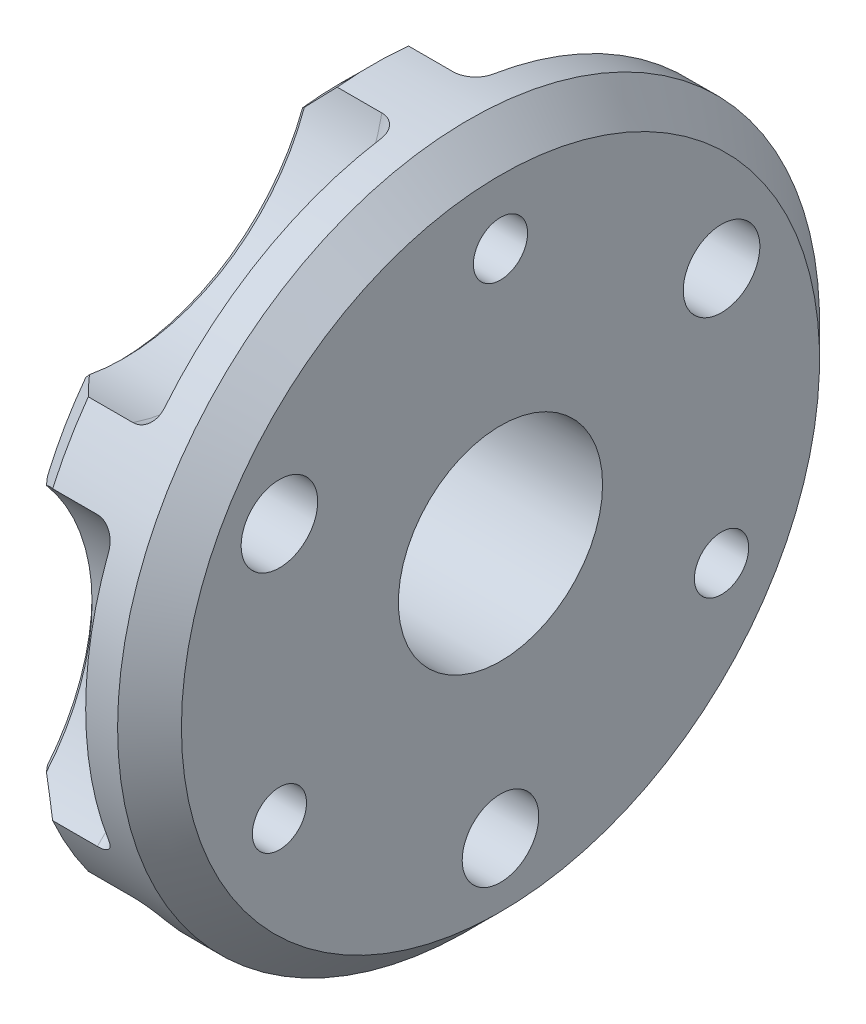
from build123d import *

# Parameters (mm, degrees)
TROU_TARAUD_M101_D      = 8.5
ESQUISSE4_R             = 9.05
EXTRUSION2_DEPTH        = 10.6
ESQUISSE5_R             = 6
EXTRUSION3_DEPTH        = 30.6
ESQUISSE6_R             = 30
EXTRUSION4_DEPTH        = 15
CHANFREIN1_SIZE         = 1
CONG_1_R                = 3
ESQUISSE7_R             = 55
ENL_V_MAT_EXTRU_1_DEPTH = 84.012047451
CHANFREIN2_SIZE         = 5
BOSS_EXTRU_1_START      = -14.4
ESQUISSE8_R             = 33.230769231
ESQUISSE8_R_2           = 11
BOSS_EXTRU_1_DEPTH      = 14.4
BOSS_EXTRU_2_START      = 3.6
ESQUISSE9_R             = 20.1
ESQUISSE9_R_2           = 11
BOSS_EXTRU_2_DEPTH      = 3.6
ESQUISSE11_R            = 16
ENL_V_MAT_EXTRU_2_DEPTH = 84.012047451
ENL_V_START             = -1
ESQUISSE12_R            = 29
ENL_V_MAT_EXTRU_3_DEPTH = 1


with BuildPart() as part:
    # Esquisse1 → R_volution1 (revolve)
    with BuildSketch(Plane.XY, mode=Mode.PRIVATE) as r_volution1_sk:
        Polygon((0, 11), (0, 29), (4, 29), (4, 50), (9, 55), (29, 55), (36, 48), (36, 37), (23, 30), (23, 20.1), (11, 20.1), (11, 11), align=None)
    revolve(r_volution1_sk.sketch.rotate(Axis((0, 0, 0), (1, 0, 0)), 90), axis=Axis((0, 0, 0), (1, 0, 0)))

    # Trou taraud_ M101 (through all)
    with Locations(Plane(origin=(4, 40, 0), x_dir=(0, 0, -1), z_dir=(-1, 0, 0))):
        with Locations((0, 0), (-34.641016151, 60), (34.641016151, 60)):
            Hole(TROU_TARAUD_M101_D / 2)

    # Esquisse4 → Extrusion2 (cut)
    with BuildSketch(Plane.ZY.offset(-4)):
        with Locations((34.641016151, 20)):
            Circle(ESQUISSE4_R)
        with Locations((0, -40)):
            Circle(ESQUISSE4_R)
        with Locations((-34.641016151, 20)):
            Circle(ESQUISSE4_R)
    extrude(amount=-EXTRUSION2_DEPTH, mode=Mode.SUBTRACT)

    # Esquisse5 → Extrusion3 (cut)
    with BuildSketch(Plane.ZY.offset(-14.6)):
        with Locations((34.641016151, 20)):
            Circle(ESQUISSE5_R)
        with Locations((-34.641016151, 20)):
            Circle(ESQUISSE5_R)
        with Locations((0, -40)):
            Circle(ESQUISSE5_R)
    extrude(amount=-EXTRUSION3_DEPTH, mode=Mode.SUBTRACT)

    # Esquisse6 → Extrusion4 (cut)
    with BuildSketch(Plane.ZY.offset(-4)):
        with Locations((35, 60.621778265)):
            Circle(ESQUISSE6_R)
        with Locations((70, 0)):
            Circle(ESQUISSE6_R)
        with Locations((35, -60.621778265)):
            Circle(ESQUISSE6_R)
        with Locations((-35, -60.621778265)):
            Circle(ESQUISSE6_R)
        with Locations((-70, 0)):
            Circle(ESQUISSE6_R)
        with Locations((-35, 60.621778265)):
            Circle(ESQUISSE6_R)
    extrude(amount=-EXTRUSION4_DEPTH, mode=Mode.SUBTRACT)

    # Chanfrein1
    chanfrein1_edges = [part.edges().sort_by_distance(p)[0] for p in [
        (4, 34.641016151, -20),
        (4, 0, -40),
        (4, -34.641016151, -20),
        (4, -34.641016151, 20),
        (4, 0, 40),
        (4, 34.641016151, 20),
    ]]
    chamfer(chanfrein1_edges, length=CHANFREIN1_SIZE)

    # Cong_1
    cong_1_edges = [part.edges().sort_by_distance(p)[0] for p in [
        (19, -34.641016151, 20),
        (19, -34.641016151, -20),
        (19, 0, -40),
        (19, 34.641016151, -20),
        (19, 34.641016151, 20),
        (19, 0, 40),
    ]]
    fillet(cong_1_edges, radius=CONG_1_R)

    # Esquisse7 → Enl_v. mat.-Extru.1 (cut, through all)
    with BuildSketch(Plane.ZY.offset(-29)):
        Circle(ESQUISSE7_R)
    extrude(amount=-ENL_V_MAT_EXTRU_1_DEPTH, mode=Mode.SUBTRACT)

    # Chanfrein2
    chanfrein2_edges = [part.edges().sort_by_distance(p)[0] for p in [
        (29, 0, -55),
    ]]
    chamfer(chanfrein2_edges, length=CHANFREIN2_SIZE)

    # Esquisse8 → Boss.-Extru.1 (add)
    with BuildSketch(Plane(origin=(29, 0, 0), x_dir=(0, 0, -1), z_dir=(1, 0, 0)).offset(BOSS_EXTRU_1_START)):
        Circle(ESQUISSE8_R)
        with Locations(Location((0, 0, 0), (0, 0, 180))):
            Circle(ESQUISSE8_R_2, mode=Mode.SUBTRACT)
    extrude(amount=BOSS_EXTRU_1_DEPTH)

    # Esquisse9 → Boss.-Extru.2 (add)
    with BuildSketch(Plane.ZY.offset(-14.6).offset(BOSS_EXTRU_2_START)):
        Circle(ESQUISSE9_R)
        Circle(ESQUISSE9_R_2, mode=Mode.SUBTRACT)
    extrude(amount=-BOSS_EXTRU_2_DEPTH)

    # Esquisse11 → Enl_v. mat.-Extru.2 (cut, through all)
    with BuildSketch(Plane(origin=(29, 0, 0), x_dir=(0, 0, -1), z_dir=(1, 0, 0))):
        Circle(ESQUISSE11_R)
    extrude(amount=-ENL_V_MAT_EXTRU_2_DEPTH, mode=Mode.SUBTRACT)

    # Esquisse12 → Enl_v. mat.-Extru.3 (cut)
    with BuildSketch(Plane.ZY.offset(ENL_V_START)):
        Circle(ESQUISSE12_R)
    extrude(amount=ENL_V_MAT_EXTRU_3_DEPTH, mode=Mode.SUBTRACT)


solid = part.part
